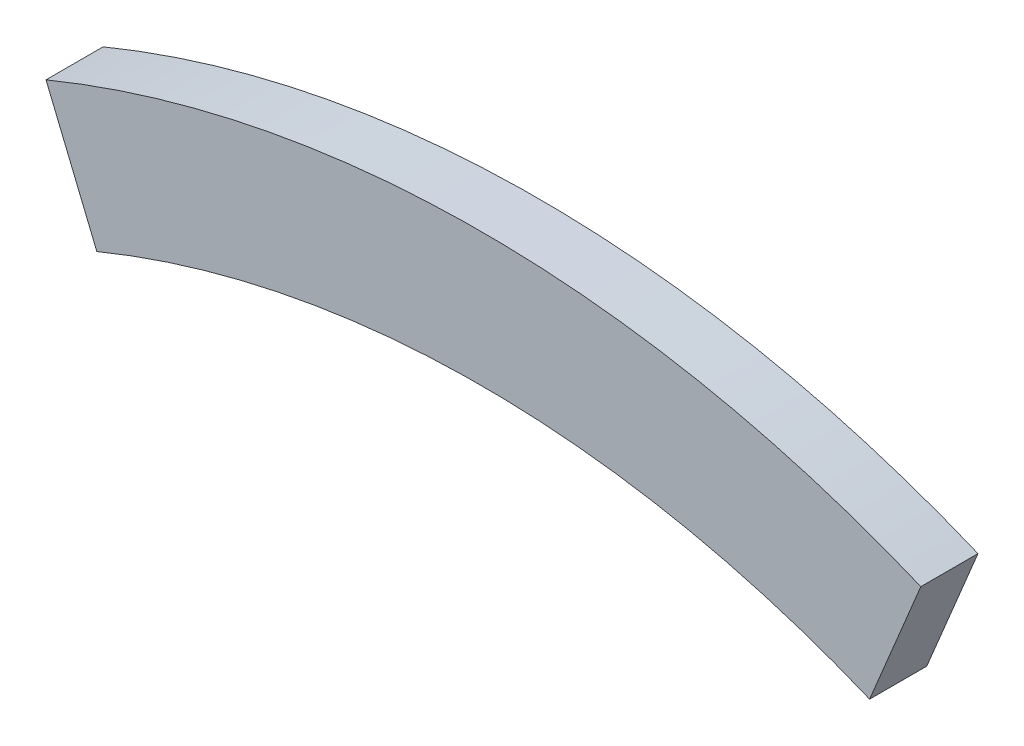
from build123d import *

# Parameters (mm, degrees)
BOSS_EXTRUDE1_DEPTH = 38.1


with BuildPart() as part:
    # Sketch2 → Boss-Extrude1 (new body)
    with BuildSketch(Plane.XY):
        with BuildLine():
            Line((0, 0), (-33.880980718, 82.190566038))
            ThreePointArc((-33.880980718, 82.190566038), (257.821910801, 139.698900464), (549.327728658, 81.199809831))
            Line((549.327728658, 81.199809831), (515.167693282, -0.875167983))
            ThreePointArc((515.167693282, -0.875167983), (257.670887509, 50.799028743), (0, 0))
        make_face()
    extrude(amount=BOSS_EXTRUDE1_DEPTH)


solid = part.part
